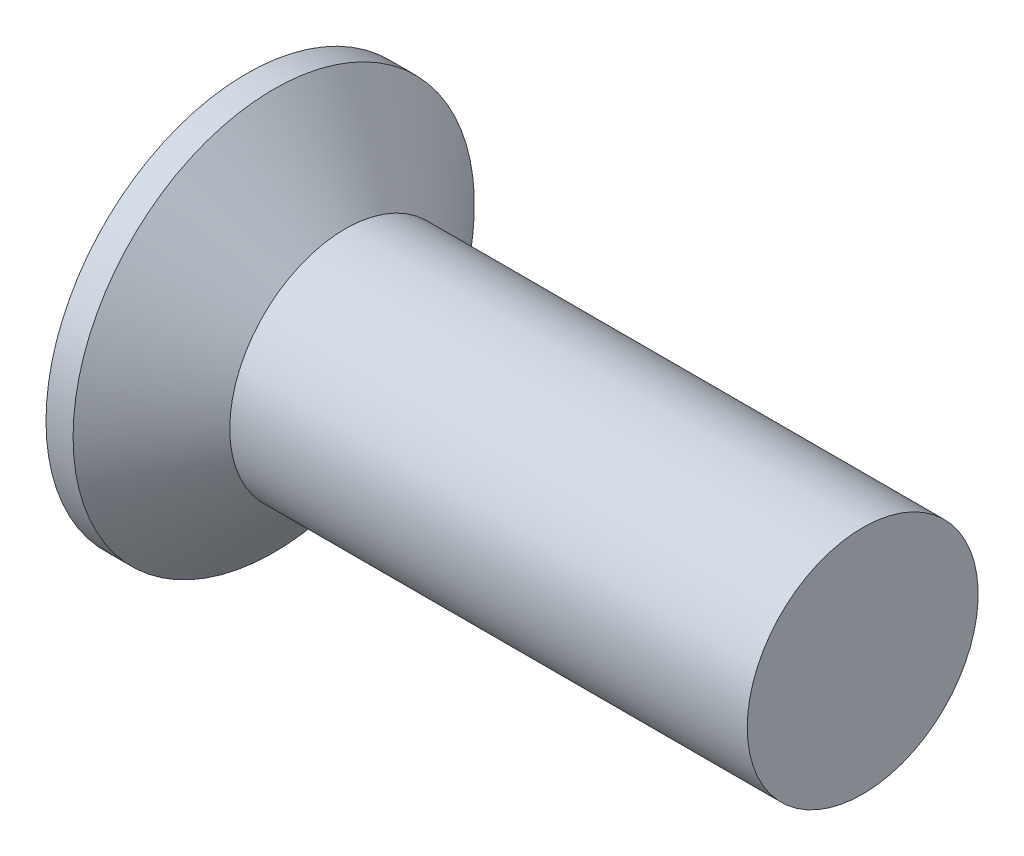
ISO-10303-21;
HEADER;
FILE_DESCRIPTION(('STEP AP214'),'2;1');
FILE_NAME('part.step','',(''),(''),'','','');
FILE_SCHEMA(('AUTOMOTIVE_DESIGN { 1 0 10303 214 1 1 1 1 }'));
ENDSEC;
DATA;
#1=APPLICATION_CONTEXT('core data for automotive mechanical design processes');
#2=APPLICATION_PROTOCOL_DEFINITION('international standard','automotive_design',2000,#1);
#3=PRODUCT_CONTEXT('',#1,'mechanical');
#4=PRODUCT('Part','Part','',(#3));
#5=PRODUCT_RELATED_PRODUCT_CATEGORY('part','',(#4));
#6=PRODUCT_DEFINITION_FORMATION('','',#4);
#7=PRODUCT_DEFINITION_CONTEXT('part definition',#1,'design');
#8=PRODUCT_DEFINITION('design','',#6,#7);
#9=PRODUCT_DEFINITION_SHAPE('','',#8);
#10=(LENGTH_UNIT() NAMED_UNIT(*) SI_UNIT(.MILLI.,.METRE.));
#11=(NAMED_UNIT(*) PLANE_ANGLE_UNIT() SI_UNIT($,.RADIAN.));
#12=(NAMED_UNIT(*) SI_UNIT($,.STERADIAN.) SOLID_ANGLE_UNIT());
#13=UNCERTAINTY_MEASURE_WITH_UNIT(LENGTH_MEASURE(1.E-05),#10,'distance_accuracy_value','');
#14=(GEOMETRIC_REPRESENTATION_CONTEXT(3) GLOBAL_UNCERTAINTY_ASSIGNED_CONTEXT((#13)) GLOBAL_UNIT_ASSIGNED_CONTEXT((#10,
#11,#12)) REPRESENTATION_CONTEXT('',''));
#15=CARTESIAN_POINT('',(0.,0.,0.));
#16=DIRECTION('',(0.,0.,1.));
#17=DIRECTION('',(1.,0.,0.));
#18=AXIS2_PLACEMENT_3D('',#15,#16,#17);
#19=CARTESIAN_POINT('',(0.,0.,0.));
#20=DIRECTION('',(-1.,0.,0.));
#21=DIRECTION('',(0.,0.,1.));
#22=AXIS2_PLACEMENT_3D('',#19,#20,#21);
#23=PLANE('',#22);
#24=CARTESIAN_POINT('',(0.,0.,0.));
#25=DIRECTION('',(-1.,0.,0.));
#26=DIRECTION('',(0.,0.,1.));
#27=AXIS2_PLACEMENT_3D('',#24,#25,#26);
#28=CIRCLE('',#27,3.6195);
#29=CARTESIAN_POINT('',(0.,0.,3.6195));
#30=VERTEX_POINT('',#29);
#31=EDGE_CURVE('E54',#30,#30,#28,.T.);
#32=ORIENTED_EDGE('',*,*,#31,.T.);
#33=EDGE_LOOP('',(#32));
#34=FACE_BOUND('',#33,.T.);
#35=DIRECTION('',(0.,1.,0.));
#36=VECTOR('',#35,1.);
#37=CARTESIAN_POINT('',(0.,-2.4257,-0.4699));
#38=LINE('',#37,#36);
#39=CARTESIAN_POINT('',(0.,-2.4257,-0.4699));
#40=VERTEX_POINT('',#39);
#41=CARTESIAN_POINT('',(0.,-0.469899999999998,-0.4699));
#42=VERTEX_POINT('',#41);
#43=EDGE_CURVE('E115',#40,#42,#38,.T.);
#44=ORIENTED_EDGE('',*,*,#43,.T.);
#45=DIRECTION('',(0.,0.,-1.));
#46=VECTOR('',#45,1.);
#47=CARTESIAN_POINT('',(0.,-0.469900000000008,2.4257));
#48=LINE('',#47,#46);
#49=CARTESIAN_POINT('',(0.,-0.469899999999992,-2.4257));
#50=VERTEX_POINT('',#49);
#51=EDGE_CURVE('E95',#42,#50,#48,.T.);
#52=ORIENTED_EDGE('',*,*,#51,.T.);
#53=DIRECTION('',(0.,1.,0.));
#54=VECTOR('',#53,1.);
#55=CARTESIAN_POINT('',(0.,-0.469899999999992,-2.4257));
#56=LINE('',#55,#54);
#57=CARTESIAN_POINT('',(0.,0.469900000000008,-2.4257));
#58=VERTEX_POINT('',#57);
#59=EDGE_CURVE('E346',#50,#58,#56,.T.);
#60=ORIENTED_EDGE('',*,*,#59,.T.);
#61=DIRECTION('',(0.,0.,1.));
#62=VECTOR('',#61,1.);
#63=CARTESIAN_POINT('',(0.,0.469900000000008,-2.4257));
#64=LINE('',#63,#62);
#65=CARTESIAN_POINT('',(0.,0.469900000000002,-0.4699));
#66=VERTEX_POINT('',#65);
#67=EDGE_CURVE('E111',#58,#66,#64,.T.);
#68=ORIENTED_EDGE('',*,*,#67,.T.);
#69=CARTESIAN_POINT('',(0.,2.4257,-0.4699));
#70=VERTEX_POINT('',#69);
#71=EDGE_CURVE('E105',#66,#70,#38,.T.);
#72=ORIENTED_EDGE('',*,*,#71,.T.);
#73=DIRECTION('',(0.,0.,1.));
#74=VECTOR('',#73,1.);
#75=CARTESIAN_POINT('',(0.,2.4257,-0.4699));
#76=LINE('',#75,#74);
#77=CARTESIAN_POINT('',(0.,2.4257,0.4699));
#78=VERTEX_POINT('',#77);
#79=EDGE_CURVE('E108',#70,#78,#76,.T.);
#80=ORIENTED_EDGE('',*,*,#79,.T.);
#81=DIRECTION('',(0.,-1.,0.));
#82=VECTOR('',#81,1.);
#83=CARTESIAN_POINT('',(0.,2.4257,0.4699));
#84=LINE('',#83,#82);
#85=CARTESIAN_POINT('',(0.,0.469899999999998,0.4699));
#86=VERTEX_POINT('',#85);
#87=EDGE_CURVE('E358',#78,#86,#84,.T.);
#88=ORIENTED_EDGE('',*,*,#87,.T.);
#89=CARTESIAN_POINT('',(0.,0.469899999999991,2.4257));
#90=VERTEX_POINT('',#89);
#91=EDGE_CURVE('E341',#86,#90,#64,.T.);
#92=ORIENTED_EDGE('',*,*,#91,.T.);
#93=DIRECTION('',(0.,-1.,0.));
#94=VECTOR('',#93,1.);
#95=CARTESIAN_POINT('',(0.,0.469899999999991,2.4257));
#96=LINE('',#95,#94);
#97=CARTESIAN_POINT('',(0.,-0.469900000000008,2.4257));
#98=VERTEX_POINT('',#97);
#99=EDGE_CURVE('E327',#90,#98,#96,.T.);
#100=ORIENTED_EDGE('',*,*,#99,.T.);
#101=CARTESIAN_POINT('',(0.,-0.469900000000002,0.4699));
#102=VERTEX_POINT('',#101);
#103=EDGE_CURVE('E339',#98,#102,#48,.T.);
#104=ORIENTED_EDGE('',*,*,#103,.T.);
#105=CARTESIAN_POINT('',(0.,-2.4257,0.4699));
#106=VERTEX_POINT('',#105);
#107=EDGE_CURVE('E121',#102,#106,#84,.T.);
#108=ORIENTED_EDGE('',*,*,#107,.T.);
#109=DIRECTION('',(0.,0.,-1.));
#110=VECTOR('',#109,1.);
#111=CARTESIAN_POINT('',(0.,-2.4257,0.4699));
#112=LINE('',#111,#110);
#113=EDGE_CURVE('E144',#106,#40,#112,.T.);
#114=ORIENTED_EDGE('',*,*,#113,.T.);
#115=EDGE_LOOP('',(#44,#52,#60,#68,#72,#80,#88,#92,#100,#104,#108,#114));
#116=FACE_BOUND('',#115,.T.);
#117=ADVANCED_FACE('F47',(#34,#116),#23,.T.);
#118=CARTESIAN_POINT('',(3.4873831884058,0.,0.209752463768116));
#119=DIRECTION('',(-0.0743900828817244,0.,-0.997229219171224));
#120=DIRECTION('',(-0.997229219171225,0.,0.0743900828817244));
#121=AXIS2_PLACEMENT_3D('',#118,#119,#120);
#122=PLANE('',#121);
#123=ORIENTED_EDGE('',*,*,#107,.F.);
#124=DIRECTION('',(0.994481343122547,0.0741851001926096,-0.0741851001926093));
#125=VECTOR('',#124,1.);
#126=CARTESIAN_POINT('',(3.50285782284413,-0.208598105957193,0.208598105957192));
#127=LINE('',#126,#125);
#128=CARTESIAN_POINT('',(3.1496,-0.234950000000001,0.234949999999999));
#129=VERTEX_POINT('',#128);
#130=EDGE_CURVE('E139',#102,#129,#127,.T.);
#131=ORIENTED_EDGE('',*,*,#130,.T.);
#132=DIRECTION('',(0.81940388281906,0.56994826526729,-0.0611248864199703));
#133=VECTOR('',#132,1.);
#134=CARTESIAN_POINT('',(0.,-2.4257,0.4699));
#135=LINE('',#134,#133);
#136=EDGE_CURVE('E116',#106,#129,#135,.T.);
#137=ORIENTED_EDGE('',*,*,#136,.F.);
#138=EDGE_LOOP('',(#123,#131,#137));
#139=FACE_BOUND('',#138,.T.);
#140=ADVANCED_FACE('F167',(#139),#122,.T.);
#141=DIRECTION('',(0.81940388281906,-0.56994826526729,-0.0611248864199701));
#142=VECTOR('',#141,1.);
#143=CARTESIAN_POINT('',(0.,2.4257,0.4699));
#144=LINE('',#143,#142);
#145=CARTESIAN_POINT('',(3.1496,0.23495,0.23495));
#146=VERTEX_POINT('',#145);
#147=EDGE_CURVE('E61',#78,#146,#144,.T.);
#148=ORIENTED_EDGE('',*,*,#147,.T.);
#149=DIRECTION('',(-0.994481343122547,0.074185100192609,0.0741851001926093));
#150=VECTOR('',#149,1.);
#151=CARTESIAN_POINT('',(3.50285782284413,0.208598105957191,0.208598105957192));
#152=LINE('',#151,#150);
#153=EDGE_CURVE('E354',#146,#86,#152,.T.);
#154=ORIENTED_EDGE('',*,*,#153,.T.);
#155=ORIENTED_EDGE('',*,*,#87,.F.);
#156=EDGE_LOOP('',(#148,#154,#155));
#157=FACE_BOUND('',#156,.T.);
#158=ADVANCED_FACE('F172',(#157),#122,.T.);
#159=CARTESIAN_POINT('',(3.4873831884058,0.,-0.209752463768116));
#160=DIRECTION('',(-0.0743900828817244,0.,0.997229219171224));
#161=DIRECTION('',(0.997229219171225,0.,0.0743900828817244));
#162=AXIS2_PLACEMENT_3D('',#159,#160,#161);
#163=PLANE('',#162);
#164=DIRECTION('',(0.81940388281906,0.56994826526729,0.0611248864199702));
#165=VECTOR('',#164,1.);
#166=CARTESIAN_POINT('',(0.,-2.4257,-0.4699));
#167=LINE('',#166,#165);
#168=CARTESIAN_POINT('',(3.1496,-0.234949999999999,-0.234950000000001));
#169=VERTEX_POINT('',#168);
#170=EDGE_CURVE('E70',#40,#169,#167,.T.);
#171=ORIENTED_EDGE('',*,*,#170,.T.);
#172=DIRECTION('',(-0.994481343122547,-0.0741851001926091,-0.0741851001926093));
#173=VECTOR('',#172,1.);
#174=CARTESIAN_POINT('',(3.50285782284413,-0.208598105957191,-0.208598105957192));
#175=LINE('',#174,#173);
#176=EDGE_CURVE('E11',#169,#42,#175,.T.);
#177=ORIENTED_EDGE('',*,*,#176,.T.);
#178=ORIENTED_EDGE('',*,*,#43,.F.);
#179=EDGE_LOOP('',(#171,#177,#178));
#180=FACE_BOUND('',#179,.T.);
#181=ADVANCED_FACE('F164',(#180),#163,.T.);
#182=ORIENTED_EDGE('',*,*,#71,.F.);
#183=DIRECTION('',(0.994481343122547,-0.0741851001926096,0.0741851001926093));
#184=VECTOR('',#183,1.);
#185=CARTESIAN_POINT('',(3.50285782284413,0.208598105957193,-0.208598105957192));
#186=LINE('',#185,#184);
#187=CARTESIAN_POINT('',(3.1496,0.23495,-0.23495));
#188=VERTEX_POINT('',#187);
#189=EDGE_CURVE('E124',#66,#188,#186,.T.);
#190=ORIENTED_EDGE('',*,*,#189,.T.);
#191=DIRECTION('',(0.81940388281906,-0.56994826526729,0.0611248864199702));
#192=VECTOR('',#191,1.);
#193=CARTESIAN_POINT('',(0.,2.4257,-0.4699));
#194=LINE('',#193,#192);
#195=EDGE_CURVE('E120',#70,#188,#194,.T.);
#196=ORIENTED_EDGE('',*,*,#195,.F.);
#197=EDGE_LOOP('',(#182,#190,#196));
#198=FACE_BOUND('',#197,.T.);
#199=ADVANCED_FACE('F123',(#198),#163,.T.);
#200=CARTESIAN_POINT('',(-6.34999999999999,0.,0.));
#201=DIRECTION('',(-1.,0.,0.));
#202=DIRECTION('',(0.,0.,1.));
#203=AXIS2_PLACEMENT_3D('',#200,#201,#202);
#204=CYLINDRICAL_SURFACE('',#203,3.6195);
#205=CARTESIAN_POINT('',(0.48855559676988,0.,0.));
#206=DIRECTION('',(-1.,0.,0.));
#207=DIRECTION('',(0.,0.,1.));
#208=AXIS2_PLACEMENT_3D('',#205,#206,#207);
#209=CIRCLE('',#208,3.6195);
#210=CARTESIAN_POINT('',(0.48855559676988,0.,3.6195));
#211=VERTEX_POINT('',#210);
#212=EDGE_CURVE('E147',#211,#211,#209,.T.);
#213=ORIENTED_EDGE('',*,*,#212,.T.);
#214=EDGE_LOOP('',(#213));
#215=FACE_BOUND('',#214,.T.);
#216=ORIENTED_EDGE('',*,*,#31,.F.);
#217=EDGE_LOOP('',(#216));
#218=FACE_BOUND('',#217,.T.);
#219=ADVANCED_FACE('F153',(#215,#218),#204,.T.);
#220=CARTESIAN_POINT('',(0.48855559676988,0.,0.));
#221=DIRECTION('',(-1.,0.,0.));
#222=DIRECTION('',(0.,0.,1.));
#223=AXIS2_PLACEMENT_3D('',#220,#221,#222);
#224=CONICAL_SURFACE('',#223,3.6195,0.872664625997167);
#225=CARTESIAN_POINT('',(1.778,0.,0.));
#226=DIRECTION('',(-1.,0.,0.));
#227=DIRECTION('',(0.,0.,1.));
#228=AXIS2_PLACEMENT_3D('',#225,#226,#227);
#229=CIRCLE('',#228,2.0828);
#230=CARTESIAN_POINT('',(1.778,0.,2.0828));
#231=VERTEX_POINT('',#230);
#232=EDGE_CURVE('E143',#231,#231,#229,.T.);
#233=ORIENTED_EDGE('',*,*,#232,.T.);
#234=EDGE_LOOP('',(#233));
#235=FACE_BOUND('',#234,.T.);
#236=ORIENTED_EDGE('',*,*,#212,.F.);
#237=EDGE_LOOP('',(#236));
#238=FACE_BOUND('',#237,.T.);
#239=ADVANCED_FACE('F155',(#235,#238),#224,.T.);
#240=CARTESIAN_POINT('',(-6.34999999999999,0.,0.));
#241=DIRECTION('',(-1.,0.,0.));
#242=DIRECTION('',(0.,0.,1.));
#243=AXIS2_PLACEMENT_3D('',#240,#241,#242);
#244=CYLINDRICAL_SURFACE('',#243,2.0828);
#245=CARTESIAN_POINT('',(11.1125,0.,0.));
#246=DIRECTION('',(-1.,0.,0.));
#247=DIRECTION('',(0.,0.,1.));
#248=AXIS2_PLACEMENT_3D('',#245,#246,#247);
#249=CIRCLE('',#248,2.0828);
#250=CARTESIAN_POINT('',(11.1125,0.,2.0828));
#251=VERTEX_POINT('',#250);
#252=EDGE_CURVE('E140',#251,#251,#249,.T.);
#253=ORIENTED_EDGE('',*,*,#252,.T.);
#254=EDGE_LOOP('',(#253));
#255=FACE_BOUND('',#254,.T.);
#256=ORIENTED_EDGE('',*,*,#232,.F.);
#257=EDGE_LOOP('',(#256));
#258=FACE_BOUND('',#257,.T.);
#259=ADVANCED_FACE('F160',(#255,#258),#244,.T.);
#260=CARTESIAN_POINT('',(11.1125,2.0828,0.));
#261=DIRECTION('',(1.,0.,0.));
#262=DIRECTION('',(0.,0.,-1.));
#263=AXIS2_PLACEMENT_3D('',#260,#261,#262);
#264=PLANE('',#263);
#265=ORIENTED_EDGE('',*,*,#252,.F.);
#266=EDGE_LOOP('',(#265));
#267=FACE_BOUND('',#266,.T.);
#268=ADVANCED_FACE('F192',(#267),#264,.T.);
#269=CARTESIAN_POINT('',(3.1496,0.23495,-0.23495));
#270=DIRECTION('',(1.,0.,0.));
#271=DIRECTION('',(0.,0.,-1.));
#272=AXIS2_PLACEMENT_3D('',#269,#270,#271);
#273=PLANE('',#272);
#274=DIRECTION('',(0.,1.,0.));
#275=VECTOR('',#274,1.);
#276=CARTESIAN_POINT('',(3.1496,-0.23495,-0.23495));
#277=LINE('',#276,#275);
#278=EDGE_CURVE('E135',#169,#188,#277,.T.);
#279=ORIENTED_EDGE('',*,*,#278,.F.);
#280=DIRECTION('',(0.,0.,-1.));
#281=VECTOR('',#280,1.);
#282=CARTESIAN_POINT('',(3.1496,-0.23495,0.23495));
#283=LINE('',#282,#281);
#284=EDGE_CURVE('E126',#129,#169,#283,.T.);
#285=ORIENTED_EDGE('',*,*,#284,.F.);
#286=DIRECTION('',(0.,-1.,0.));
#287=VECTOR('',#286,1.);
#288=CARTESIAN_POINT('',(3.1496,0.23495,0.23495));
#289=LINE('',#288,#287);
#290=EDGE_CURVE('E129',#146,#129,#289,.T.);
#291=ORIENTED_EDGE('',*,*,#290,.F.);
#292=DIRECTION('',(0.,0.,1.));
#293=VECTOR('',#292,1.);
#294=CARTESIAN_POINT('',(3.1496,0.23495,-0.23495));
#295=LINE('',#294,#293);
#296=EDGE_CURVE('E133',#188,#146,#295,.T.);
#297=ORIENTED_EDGE('',*,*,#296,.F.);
#298=EDGE_LOOP('',(#279,#285,#291,#297));
#299=FACE_BOUND('',#298,.T.);
#300=ADVANCED_FACE('F189',(#299),#273,.F.);
#301=CARTESIAN_POINT('',(0.,-2.4257,-0.4699));
#302=DIRECTION('',(-0.571015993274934,0.820938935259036,0.));
#303=DIRECTION('',(-0.820938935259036,-0.571015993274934,0.));
#304=AXIS2_PLACEMENT_3D('',#301,#302,#303);
#305=PLANE('',#304);
#306=ORIENTED_EDGE('',*,*,#170,.F.);
#307=ORIENTED_EDGE('',*,*,#113,.F.);
#308=ORIENTED_EDGE('',*,*,#136,.T.);
#309=ORIENTED_EDGE('',*,*,#284,.T.);
#310=EDGE_LOOP('',(#306,#307,#308,#309));
#311=FACE_BOUND('',#310,.T.);
#312=ADVANCED_FACE('F181',(#311),#305,.T.);
#313=CARTESIAN_POINT('',(3.1496,0.23495,0.23495));
#314=DIRECTION('',(-0.571015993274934,-0.820938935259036,0.));
#315=DIRECTION('',(0.820938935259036,-0.571015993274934,0.));
#316=AXIS2_PLACEMENT_3D('',#313,#314,#315);
#317=PLANE('',#316);
#318=ORIENTED_EDGE('',*,*,#147,.F.);
#319=ORIENTED_EDGE('',*,*,#79,.F.);
#320=ORIENTED_EDGE('',*,*,#195,.T.);
#321=ORIENTED_EDGE('',*,*,#296,.T.);
#322=EDGE_LOOP('',(#318,#319,#320,#321));
#323=FACE_BOUND('',#322,.T.);
#324=ADVANCED_FACE('F119',(#323),#317,.T.);
#325=CARTESIAN_POINT('',(3.4873831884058,-0.209752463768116,0.));
#326=DIRECTION('',(-0.0743900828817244,0.997229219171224,0.));
#327=DIRECTION('',(-0.997229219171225,-0.0743900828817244,0.));
#328=AXIS2_PLACEMENT_3D('',#325,#326,#327);
#329=PLANE('',#328);
#330=DIRECTION('',(0.81940388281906,0.0611248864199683,0.56994826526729));
#331=VECTOR('',#330,1.);
#332=CARTESIAN_POINT('',(0.,-0.469899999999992,-2.4257));
#333=LINE('',#332,#331);
#334=EDGE_CURVE('E348',#50,#169,#333,.T.);
#335=ORIENTED_EDGE('',*,*,#334,.F.);
#336=ORIENTED_EDGE('',*,*,#51,.F.);
#337=ORIENTED_EDGE('',*,*,#176,.F.);
#338=EDGE_LOOP('',(#335,#336,#337));
#339=FACE_BOUND('',#338,.T.);
#340=ADVANCED_FACE('F188',(#339),#329,.T.);
#341=CARTESIAN_POINT('',(3.4873831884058,0.209752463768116,0.));
#342=DIRECTION('',(-0.0743900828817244,-0.997229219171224,0.));
#343=DIRECTION('',(0.997229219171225,-0.0743900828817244,0.));
#344=AXIS2_PLACEMENT_3D('',#341,#342,#343);
#345=PLANE('',#344);
#346=ORIENTED_EDGE('',*,*,#67,.F.);
#347=DIRECTION('',(0.81940388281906,-0.0611248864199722,0.56994826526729));
#348=VECTOR('',#347,1.);
#349=CARTESIAN_POINT('',(0.,0.469900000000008,-2.4257));
#350=LINE('',#349,#348);
#351=EDGE_CURVE('E86',#58,#188,#350,.T.);
#352=ORIENTED_EDGE('',*,*,#351,.T.);
#353=ORIENTED_EDGE('',*,*,#189,.F.);
#354=EDGE_LOOP('',(#346,#352,#353));
#355=FACE_BOUND('',#354,.T.);
#356=ADVANCED_FACE('F272',(#355),#345,.T.);
#357=CARTESIAN_POINT('',(0.,0.469900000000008,-2.4257));
#358=DIRECTION('',(-0.571015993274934,0.,0.820938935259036));
#359=DIRECTION('',(-0.820938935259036,0.,-0.571015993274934));
#360=AXIS2_PLACEMENT_3D('',#357,#358,#359);
#361=PLANE('',#360);
#362=ORIENTED_EDGE('',*,*,#351,.F.);
#363=ORIENTED_EDGE('',*,*,#59,.F.);
#364=ORIENTED_EDGE('',*,*,#334,.T.);
#365=ORIENTED_EDGE('',*,*,#278,.T.);
#366=EDGE_LOOP('',(#362,#363,#364,#365));
#367=FACE_BOUND('',#366,.T.);
#368=ADVANCED_FACE('F282',(#367),#361,.T.);
#369=ORIENTED_EDGE('',*,*,#103,.F.);
#370=DIRECTION('',(0.81940388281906,0.0611248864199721,-0.56994826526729));
#371=VECTOR('',#370,1.);
#372=CARTESIAN_POINT('',(0.,-0.469900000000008,2.4257));
#373=LINE('',#372,#371);
#374=EDGE_CURVE('E324',#98,#129,#373,.T.);
#375=ORIENTED_EDGE('',*,*,#374,.T.);
#376=ORIENTED_EDGE('',*,*,#130,.F.);
#377=EDGE_LOOP('',(#369,#375,#376));
#378=FACE_BOUND('',#377,.T.);
#379=ADVANCED_FACE('F274',(#378),#329,.T.);
#380=DIRECTION('',(0.81940388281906,-0.0611248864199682,-0.56994826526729));
#381=VECTOR('',#380,1.);
#382=CARTESIAN_POINT('',(0.,0.469899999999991,2.4257));
#383=LINE('',#382,#381);
#384=EDGE_CURVE('E335',#90,#146,#383,.T.);
#385=ORIENTED_EDGE('',*,*,#384,.F.);
#386=ORIENTED_EDGE('',*,*,#91,.F.);
#387=ORIENTED_EDGE('',*,*,#153,.F.);
#388=EDGE_LOOP('',(#385,#386,#387));
#389=FACE_BOUND('',#388,.T.);
#390=ADVANCED_FACE('F284',(#389),#345,.T.);
#391=CARTESIAN_POINT('',(3.1496,-0.234950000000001,0.234949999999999));
#392=DIRECTION('',(-0.571015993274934,0.,-0.820938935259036));
#393=DIRECTION('',(0.820938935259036,0.,-0.571015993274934));
#394=AXIS2_PLACEMENT_3D('',#391,#392,#393);
#395=PLANE('',#394);
#396=ORIENTED_EDGE('',*,*,#374,.F.);
#397=ORIENTED_EDGE('',*,*,#99,.F.);
#398=ORIENTED_EDGE('',*,*,#384,.T.);
#399=ORIENTED_EDGE('',*,*,#290,.T.);
#400=EDGE_LOOP('',(#396,#397,#398,#399));
#401=FACE_BOUND('',#400,.T.);
#402=ADVANCED_FACE('F309',(#401),#395,.T.);
#403=CLOSED_SHELL('',(#117,#140,#158,#181,#199,#219,#239,#259,#268,#300,#312,#324,#340,#356,
#368,#379,#390,#402));
#404=MANIFOLD_SOLID_BREP('B2',#403);
#405=ADVANCED_BREP_SHAPE_REPRESENTATION('',(#18,#404),#14);
#406=SHAPE_DEFINITION_REPRESENTATION(#9,#405);
ENDSEC;
END-ISO-10303-21;
